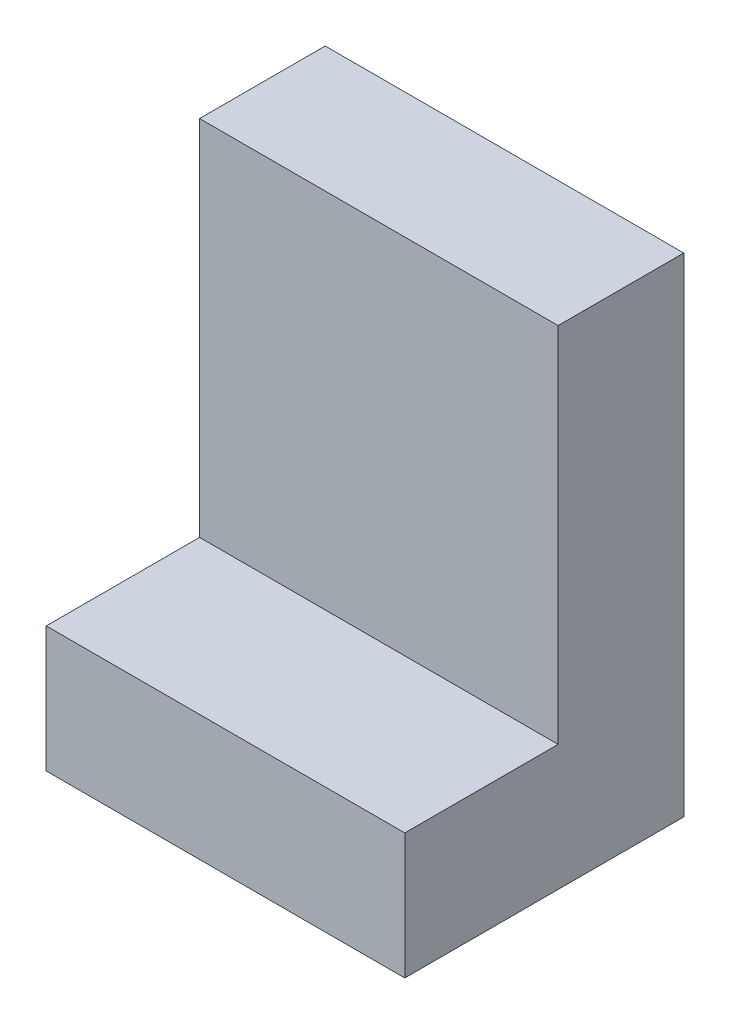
ISO-10303-21;
HEADER;
FILE_DESCRIPTION(('STEP AP214'),'2;1');
FILE_NAME('part.step','',(''),(''),'','','');
FILE_SCHEMA(('AUTOMOTIVE_DESIGN { 1 0 10303 214 1 1 1 1 }'));
ENDSEC;
DATA;
#1=APPLICATION_CONTEXT('core data for automotive mechanical design processes');
#2=APPLICATION_PROTOCOL_DEFINITION('international standard','automotive_design',2000,#1);
#3=PRODUCT_CONTEXT('',#1,'mechanical');
#4=PRODUCT('Part','Part','',(#3));
#5=PRODUCT_RELATED_PRODUCT_CATEGORY('part','',(#4));
#6=PRODUCT_DEFINITION_FORMATION('','',#4);
#7=PRODUCT_DEFINITION_CONTEXT('part definition',#1,'design');
#8=PRODUCT_DEFINITION('design','',#6,#7);
#9=PRODUCT_DEFINITION_SHAPE('','',#8);
#10=(LENGTH_UNIT() NAMED_UNIT(*) SI_UNIT(.MILLI.,.METRE.));
#11=(NAMED_UNIT(*) PLANE_ANGLE_UNIT() SI_UNIT($,.RADIAN.));
#12=(NAMED_UNIT(*) SI_UNIT($,.STERADIAN.) SOLID_ANGLE_UNIT());
#13=UNCERTAINTY_MEASURE_WITH_UNIT(LENGTH_MEASURE(1.E-05),#10,'distance_accuracy_value','');
#14=(GEOMETRIC_REPRESENTATION_CONTEXT(3) GLOBAL_UNCERTAINTY_ASSIGNED_CONTEXT((#13)) GLOBAL_UNIT_ASSIGNED_CONTEXT((#10,
#11,#12)) REPRESENTATION_CONTEXT('',''));
#15=CARTESIAN_POINT('',(0.,0.,0.));
#16=DIRECTION('',(0.,0.,1.));
#17=DIRECTION('',(1.,0.,0.));
#18=AXIS2_PLACEMENT_3D('',#15,#16,#17);
#19=CARTESIAN_POINT('',(50.,17.5224720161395,0.));
#20=DIRECTION('',(0.,0.,-1.));
#21=DIRECTION('',(-1.,0.,0.));
#22=AXIS2_PLACEMENT_3D('',#19,#20,#21);
#23=PLANE('',#22);
#24=DIRECTION('',(0.,-1.,0.));
#25=VECTOR('',#24,1.);
#26=CARTESIAN_POINT('',(0.,17.5224720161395,0.));
#27=LINE('',#26,#25);
#28=CARTESIAN_POINT('',(0.,17.5224720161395,0.));
#29=VERTEX_POINT('',#28);
#30=CARTESIAN_POINT('',(0.,0.,0.));
#31=VERTEX_POINT('',#30);
#32=EDGE_CURVE('E116',#29,#31,#27,.T.);
#33=ORIENTED_EDGE('',*,*,#32,.T.);
#34=DIRECTION('',(-1.,0.,0.));
#35=VECTOR('',#34,1.);
#36=CARTESIAN_POINT('',(50.,0.,0.));
#37=LINE('',#36,#35);
#38=CARTESIAN_POINT('',(50.,0.,0.));
#39=VERTEX_POINT('',#38);
#40=EDGE_CURVE('E11',#39,#31,#37,.T.);
#41=ORIENTED_EDGE('',*,*,#40,.F.);
#42=DIRECTION('',(0.,-1.,0.));
#43=VECTOR('',#42,1.);
#44=CARTESIAN_POINT('',(50.,17.5224720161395,0.));
#45=LINE('',#44,#43);
#46=CARTESIAN_POINT('',(50.,17.5224720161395,0.));
#47=VERTEX_POINT('',#46);
#48=EDGE_CURVE('E126',#47,#39,#45,.T.);
#49=ORIENTED_EDGE('',*,*,#48,.F.);
#50=DIRECTION('',(-1.,0.,0.));
#51=VECTOR('',#50,1.);
#52=CARTESIAN_POINT('',(50.,17.5224720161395,0.));
#53=LINE('',#52,#51);
#54=EDGE_CURVE('E112',#47,#29,#53,.T.);
#55=ORIENTED_EDGE('',*,*,#54,.T.);
#56=EDGE_LOOP('',(#33,#41,#49,#55));
#57=FACE_BOUND('',#56,.T.);
#58=ADVANCED_FACE('F32',(#57),#23,.F.);
#59=CARTESIAN_POINT('',(50.,0.,0.));
#60=DIRECTION('',(0.,1.,0.));
#61=DIRECTION('',(0.,0.,1.));
#62=AXIS2_PLACEMENT_3D('',#59,#60,#61);
#63=PLANE('',#62);
#64=DIRECTION('',(0.,0.,-1.));
#65=VECTOR('',#64,1.);
#66=CARTESIAN_POINT('',(0.,0.,0.));
#67=LINE('',#66,#65);
#68=CARTESIAN_POINT('',(0.,0.,-38.9073620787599));
#69=VERTEX_POINT('',#68);
#70=EDGE_CURVE('E119',#31,#69,#67,.T.);
#71=ORIENTED_EDGE('',*,*,#70,.T.);
#72=DIRECTION('',(-1.,0.,0.));
#73=VECTOR('',#72,1.);
#74=CARTESIAN_POINT('',(50.,0.,-38.9073620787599));
#75=LINE('',#74,#73);
#76=CARTESIAN_POINT('',(50.,0.,-38.9073620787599));
#77=VERTEX_POINT('',#76);
#78=EDGE_CURVE('E40',#77,#69,#75,.T.);
#79=ORIENTED_EDGE('',*,*,#78,.F.);
#80=DIRECTION('',(0.,0.,-1.));
#81=VECTOR('',#80,1.);
#82=CARTESIAN_POINT('',(50.,0.,0.));
#83=LINE('',#82,#81);
#84=EDGE_CURVE('E85',#39,#77,#83,.T.);
#85=ORIENTED_EDGE('',*,*,#84,.F.);
#86=ORIENTED_EDGE('',*,*,#40,.T.);
#87=EDGE_LOOP('',(#71,#79,#85,#86));
#88=FACE_BOUND('',#87,.T.);
#89=ADVANCED_FACE('F150',(#88),#63,.F.);
#90=CARTESIAN_POINT('',(50.,0.,-38.9073620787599));
#91=DIRECTION('',(0.,0.,1.));
#92=DIRECTION('',(1.,0.,0.));
#93=AXIS2_PLACEMENT_3D('',#90,#91,#92);
#94=PLANE('',#93);
#95=DIRECTION('',(0.,1.,0.));
#96=VECTOR('',#95,1.);
#97=CARTESIAN_POINT('',(0.,0.,-38.9073620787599));
#98=LINE('',#97,#96);
#99=CARTESIAN_POINT('',(0.,68.1052856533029,-38.9073620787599));
#100=VERTEX_POINT('',#99);
#101=EDGE_CURVE('E121',#69,#100,#98,.T.);
#102=ORIENTED_EDGE('',*,*,#101,.T.);
#103=DIRECTION('',(-1.,0.,0.));
#104=VECTOR('',#103,1.);
#105=CARTESIAN_POINT('',(50.,68.1052856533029,-38.9073620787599));
#106=LINE('',#105,#104);
#107=CARTESIAN_POINT('',(50.,68.1052856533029,-38.9073620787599));
#108=VERTEX_POINT('',#107);
#109=EDGE_CURVE('E107',#108,#100,#106,.T.);
#110=ORIENTED_EDGE('',*,*,#109,.F.);
#111=DIRECTION('',(0.,1.,0.));
#112=VECTOR('',#111,1.);
#113=CARTESIAN_POINT('',(50.,0.,-38.9073620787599));
#114=LINE('',#113,#112);
#115=EDGE_CURVE('E98',#77,#108,#114,.T.);
#116=ORIENTED_EDGE('',*,*,#115,.F.);
#117=ORIENTED_EDGE('',*,*,#78,.T.);
#118=EDGE_LOOP('',(#102,#110,#116,#117));
#119=FACE_BOUND('',#118,.T.);
#120=ADVANCED_FACE('F132',(#119),#94,.F.);
#121=CARTESIAN_POINT('',(50.,68.1052856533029,-38.9073620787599));
#122=DIRECTION('',(0.,-1.,0.));
#123=DIRECTION('',(0.,0.,-1.));
#124=AXIS2_PLACEMENT_3D('',#121,#122,#123);
#125=PLANE('',#124);
#126=DIRECTION('',(0.,0.,1.));
#127=VECTOR('',#126,1.);
#128=CARTESIAN_POINT('',(0.,68.1052856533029,-38.9073620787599));
#129=LINE('',#128,#127);
#130=CARTESIAN_POINT('',(0.,68.1052856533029,-21.3848900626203));
#131=VERTEX_POINT('',#130);
#132=EDGE_CURVE('E106',#100,#131,#129,.T.);
#133=ORIENTED_EDGE('',*,*,#132,.T.);
#134=DIRECTION('',(-1.,0.,0.));
#135=VECTOR('',#134,1.);
#136=CARTESIAN_POINT('',(50.,68.1052856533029,-21.3848900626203));
#137=LINE('',#136,#135);
#138=CARTESIAN_POINT('',(50.,68.1052856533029,-21.3848900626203));
#139=VERTEX_POINT('',#138);
#140=EDGE_CURVE('E103',#139,#131,#137,.T.);
#141=ORIENTED_EDGE('',*,*,#140,.F.);
#142=DIRECTION('',(0.,0.,1.));
#143=VECTOR('',#142,1.);
#144=CARTESIAN_POINT('',(50.,68.1052856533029,-38.9073620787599));
#145=LINE('',#144,#143);
#146=EDGE_CURVE('E92',#108,#139,#145,.T.);
#147=ORIENTED_EDGE('',*,*,#146,.F.);
#148=ORIENTED_EDGE('',*,*,#109,.T.);
#149=EDGE_LOOP('',(#133,#141,#147,#148));
#150=FACE_BOUND('',#149,.T.);
#151=ADVANCED_FACE('F104',(#150),#125,.F.);
#152=CARTESIAN_POINT('',(50.,68.1052856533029,-21.3848900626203));
#153=DIRECTION('',(0.,0.,-1.));
#154=DIRECTION('',(-1.,0.,0.));
#155=AXIS2_PLACEMENT_3D('',#152,#153,#154);
#156=PLANE('',#155);
#157=DIRECTION('',(0.,-1.,0.));
#158=VECTOR('',#157,1.);
#159=CARTESIAN_POINT('',(0.,68.1052856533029,-21.3848900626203));
#160=LINE('',#159,#158);
#161=CARTESIAN_POINT('',(0.,17.5224720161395,-21.3848900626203));
#162=VERTEX_POINT('',#161);
#163=EDGE_CURVE('E71',#131,#162,#160,.T.);
#164=ORIENTED_EDGE('',*,*,#163,.T.);
#165=DIRECTION('',(-1.,0.,0.));
#166=VECTOR('',#165,1.);
#167=CARTESIAN_POINT('',(50.,17.5224720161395,-21.3848900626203));
#168=LINE('',#167,#166);
#169=CARTESIAN_POINT('',(50.,17.5224720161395,-21.3848900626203));
#170=VERTEX_POINT('',#169);
#171=EDGE_CURVE('E108',#170,#162,#168,.T.);
#172=ORIENTED_EDGE('',*,*,#171,.F.);
#173=DIRECTION('',(0.,-1.,0.));
#174=VECTOR('',#173,1.);
#175=CARTESIAN_POINT('',(50.,68.1052856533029,-21.3848900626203));
#176=LINE('',#175,#174);
#177=EDGE_CURVE('E96',#139,#170,#176,.T.);
#178=ORIENTED_EDGE('',*,*,#177,.F.);
#179=ORIENTED_EDGE('',*,*,#140,.T.);
#180=EDGE_LOOP('',(#164,#172,#178,#179));
#181=FACE_BOUND('',#180,.T.);
#182=ADVANCED_FACE('F110',(#181),#156,.F.);
#183=CARTESIAN_POINT('',(50.,17.5224720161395,-21.3848900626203));
#184=DIRECTION('',(0.,-1.,0.));
#185=DIRECTION('',(0.,0.,-1.));
#186=AXIS2_PLACEMENT_3D('',#183,#184,#185);
#187=PLANE('',#186);
#188=DIRECTION('',(0.,0.,1.));
#189=VECTOR('',#188,1.);
#190=CARTESIAN_POINT('',(0.,17.5224720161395,-21.3848900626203));
#191=LINE('',#190,#189);
#192=EDGE_CURVE('E77',#162,#29,#191,.T.);
#193=ORIENTED_EDGE('',*,*,#192,.T.);
#194=ORIENTED_EDGE('',*,*,#54,.F.);
#195=DIRECTION('',(0.,0.,1.));
#196=VECTOR('',#195,1.);
#197=CARTESIAN_POINT('',(50.,17.5224720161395,-21.3848900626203));
#198=LINE('',#197,#196);
#199=EDGE_CURVE('E48',#170,#47,#198,.T.);
#200=ORIENTED_EDGE('',*,*,#199,.F.);
#201=ORIENTED_EDGE('',*,*,#171,.T.);
#202=EDGE_LOOP('',(#193,#194,#200,#201));
#203=FACE_BOUND('',#202,.T.);
#204=ADVANCED_FACE('F139',(#203),#187,.F.);
#205=CARTESIAN_POINT('',(50.,0.,0.));
#206=DIRECTION('',(1.,0.,0.));
#207=DIRECTION('',(0.,0.,-1.));
#208=AXIS2_PLACEMENT_3D('',#205,#206,#207);
#209=PLANE('',#208);
#210=ORIENTED_EDGE('',*,*,#48,.T.);
#211=ORIENTED_EDGE('',*,*,#84,.T.);
#212=ORIENTED_EDGE('',*,*,#115,.T.);
#213=ORIENTED_EDGE('',*,*,#146,.T.);
#214=ORIENTED_EDGE('',*,*,#177,.T.);
#215=ORIENTED_EDGE('',*,*,#199,.T.);
#216=EDGE_LOOP('',(#210,#211,#212,#213,#214,#215));
#217=FACE_BOUND('',#216,.T.);
#218=ADVANCED_FACE('F94',(#217),#209,.T.);
#219=CARTESIAN_POINT('',(0.,0.,0.));
#220=DIRECTION('',(1.,0.,0.));
#221=DIRECTION('',(0.,0.,-1.));
#222=AXIS2_PLACEMENT_3D('',#219,#220,#221);
#223=PLANE('',#222);
#224=ORIENTED_EDGE('',*,*,#32,.F.);
#225=ORIENTED_EDGE('',*,*,#192,.F.);
#226=ORIENTED_EDGE('',*,*,#163,.F.);
#227=ORIENTED_EDGE('',*,*,#132,.F.);
#228=ORIENTED_EDGE('',*,*,#101,.F.);
#229=ORIENTED_EDGE('',*,*,#70,.F.);
#230=EDGE_LOOP('',(#224,#225,#226,#227,#228,#229));
#231=FACE_BOUND('',#230,.T.);
#232=ADVANCED_FACE('F135',(#231),#223,.F.);
#233=CLOSED_SHELL('',(#58,#89,#120,#151,#182,#204,#218,#232));
#234=MANIFOLD_SOLID_BREP('B2',#233);
#235=ADVANCED_BREP_SHAPE_REPRESENTATION('',(#18,#234),#14);
#236=SHAPE_DEFINITION_REPRESENTATION(#9,#235);
ENDSEC;
END-ISO-10303-21;
